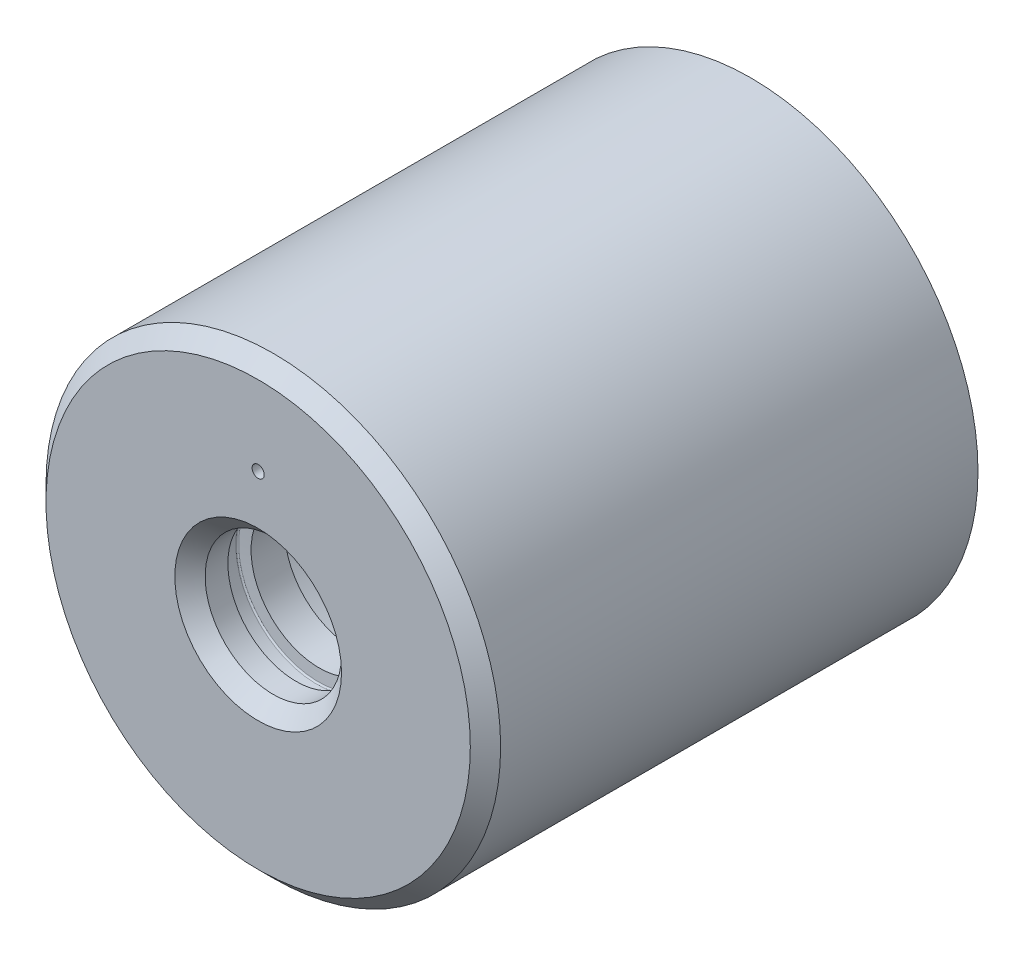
ISO-10303-21;
HEADER;
FILE_DESCRIPTION(('STEP AP214'),'2;1');
FILE_NAME('part.step','',(''),(''),'','','');
FILE_SCHEMA(('AUTOMOTIVE_DESIGN { 1 0 10303 214 1 1 1 1 }'));
ENDSEC;
DATA;
#1=APPLICATION_CONTEXT('core data for automotive mechanical design processes');
#2=APPLICATION_PROTOCOL_DEFINITION('international standard','automotive_design',2000,#1);
#3=PRODUCT_CONTEXT('',#1,'mechanical');
#4=PRODUCT('Part','Part','',(#3));
#5=PRODUCT_RELATED_PRODUCT_CATEGORY('part','',(#4));
#6=PRODUCT_DEFINITION_FORMATION('','',#4);
#7=PRODUCT_DEFINITION_CONTEXT('part definition',#1,'design');
#8=PRODUCT_DEFINITION('design','',#6,#7);
#9=PRODUCT_DEFINITION_SHAPE('','',#8);
#10=(LENGTH_UNIT() NAMED_UNIT(*) SI_UNIT(.MILLI.,.METRE.));
#11=(NAMED_UNIT(*) PLANE_ANGLE_UNIT() SI_UNIT($,.RADIAN.));
#12=(NAMED_UNIT(*) SI_UNIT($,.STERADIAN.) SOLID_ANGLE_UNIT());
#13=UNCERTAINTY_MEASURE_WITH_UNIT(LENGTH_MEASURE(1.E-05),#10,'distance_accuracy_value','');
#14=(GEOMETRIC_REPRESENTATION_CONTEXT(3) GLOBAL_UNCERTAINTY_ASSIGNED_CONTEXT((#13)) GLOBAL_UNIT_ASSIGNED_CONTEXT((#10,
#11,#12)) REPRESENTATION_CONTEXT('',''));
#15=CARTESIAN_POINT('',(0.,0.,0.));
#16=DIRECTION('',(0.,0.,1.));
#17=DIRECTION('',(1.,0.,0.));
#18=AXIS2_PLACEMENT_3D('',#15,#16,#17);
#19=CARTESIAN_POINT('',(0.,0.,82.55));
#20=DIRECTION('',(0.,0.,-1.));
#21=DIRECTION('',(-1.,0.,0.));
#22=AXIS2_PLACEMENT_3D('',#19,#20,#21);
#23=CYLINDRICAL_SURFACE('',#22,11.43);
#24=CARTESIAN_POINT('',(0.,0.,72.309016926));
#25=DIRECTION('',(0.,0.,1.));
#26=DIRECTION('',(1.,0.,0.));
#27=AXIS2_PLACEMENT_3D('',#24,#25,#26);
#28=CIRCLE('',#27,11.43);
#29=CARTESIAN_POINT('',(11.43,0.,72.309016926));
#30=VERTEX_POINT('',#29);
#31=EDGE_CURVE('E70',#30,#30,#28,.T.);
#32=ORIENTED_EDGE('',*,*,#31,.T.);
#33=EDGE_LOOP('',(#32));
#34=FACE_BOUND('',#33,.T.);
#35=CARTESIAN_POINT('',(0.,0.,66.675));
#36=DIRECTION('',(0.,0.,1.));
#37=DIRECTION('',(1.,0.,0.));
#38=AXIS2_PLACEMENT_3D('',#35,#36,#37);
#39=CIRCLE('',#38,11.43);
#40=CARTESIAN_POINT('',(11.43,0.,66.675));
#41=VERTEX_POINT('',#40);
#42=EDGE_CURVE('E61',#41,#41,#39,.T.);
#43=ORIENTED_EDGE('',*,*,#42,.F.);
#44=EDGE_LOOP('',(#43));
#45=FACE_BOUND('',#44,.T.);
#46=ADVANCED_FACE('F32',(#34,#45),#23,.F.);
#47=CARTESIAN_POINT('',(0.,0.,0.));
#48=DIRECTION('',(0.,0.,1.));
#49=DIRECTION('',(1.,0.,0.));
#50=AXIS2_PLACEMENT_3D('',#47,#48,#49);
#51=PLANE('',#50);
#52=CARTESIAN_POINT('',(0.,0.,0.));
#53=DIRECTION('',(0.,0.,1.));
#54=DIRECTION('',(1.,0.,0.));
#55=AXIS2_PLACEMENT_3D('',#52,#53,#54);
#56=CIRCLE('',#55,38.1);
#57=CARTESIAN_POINT('',(38.1,0.,0.));
#58=VERTEX_POINT('',#57);
#59=EDGE_CURVE('E52',#58,#58,#56,.T.);
#60=ORIENTED_EDGE('',*,*,#59,.F.);
#61=EDGE_LOOP('',(#60));
#62=FACE_BOUND('',#61,.T.);
#63=CARTESIAN_POINT('',(0.,0.,0.));
#64=DIRECTION('',(0.,0.,1.));
#65=DIRECTION('',(1.,0.,0.));
#66=AXIS2_PLACEMENT_3D('',#63,#64,#65);
#67=CIRCLE('',#66,26.67);
#68=CARTESIAN_POINT('',(26.67,0.,0.));
#69=VERTEX_POINT('',#68);
#70=EDGE_CURVE('E55',#69,#69,#67,.T.);
#71=ORIENTED_EDGE('',*,*,#70,.T.);
#72=EDGE_LOOP('',(#71));
#73=FACE_BOUND('',#72,.T.);
#74=ADVANCED_FACE('F127',(#62,#73),#51,.F.);
#75=CARTESIAN_POINT('',(0.,0.,66.675));
#76=DIRECTION('',(0.,0.,-1.));
#77=DIRECTION('',(-1.,0.,0.));
#78=AXIS2_PLACEMENT_3D('',#75,#76,#77);
#79=CYLINDRICAL_SURFACE('',#78,38.1);
#80=CARTESIAN_POINT('',(0.,0.,80.01));
#81=DIRECTION('',(0.,0.,1.));
#82=DIRECTION('',(1.,0.,0.));
#83=AXIS2_PLACEMENT_3D('',#80,#81,#82);
#84=CIRCLE('',#83,38.1);
#85=CARTESIAN_POINT('',(38.1,0.,80.01));
#86=VERTEX_POINT('',#85);
#87=EDGE_CURVE('E10',#86,#86,#84,.F.);
#88=ORIENTED_EDGE('',*,*,#87,.T.);
#89=EDGE_LOOP('',(#88));
#90=FACE_BOUND('',#89,.T.);
#91=ORIENTED_EDGE('',*,*,#59,.T.);
#92=EDGE_LOOP('',(#91));
#93=FACE_BOUND('',#92,.T.);
#94=ADVANCED_FACE('F34',(#90,#93),#79,.T.);
#95=CARTESIAN_POINT('',(0.,0.,66.675));
#96=DIRECTION('',(0.,0.,-1.));
#97=DIRECTION('',(-1.,0.,0.));
#98=AXIS2_PLACEMENT_3D('',#95,#96,#97);
#99=CYLINDRICAL_SURFACE('',#98,26.67);
#100=CARTESIAN_POINT('',(0.,0.,66.675));
#101=DIRECTION('',(0.,0.,1.));
#102=DIRECTION('',(1.,0.,0.));
#103=AXIS2_PLACEMENT_3D('',#100,#101,#102);
#104=CIRCLE('',#103,26.67);
#105=CARTESIAN_POINT('',(26.67,0.,66.675));
#106=VERTEX_POINT('',#105);
#107=EDGE_CURVE('E58',#106,#106,#104,.T.);
#108=ORIENTED_EDGE('',*,*,#107,.T.);
#109=EDGE_LOOP('',(#108));
#110=FACE_BOUND('',#109,.T.);
#111=ORIENTED_EDGE('',*,*,#70,.F.);
#112=EDGE_LOOP('',(#111));
#113=FACE_BOUND('',#112,.T.);
#114=ADVANCED_FACE('F141',(#110,#113),#99,.F.);
#115=CARTESIAN_POINT('',(0.,0.,82.55));
#116=DIRECTION('',(0.,0.,1.));
#117=DIRECTION('',(1.,0.,0.));
#118=AXIS2_PLACEMENT_3D('',#115,#116,#117);
#119=PLANE('',#118);
#120=CARTESIAN_POINT('',(0.,22.225,82.55));
#121=DIRECTION('',(0.,0.,1.));
#122=DIRECTION('',(1.,0.,0.));
#123=AXIS2_PLACEMENT_3D('',#120,#121,#122);
#124=CIRCLE('',#123,1.016);
#125=CARTESIAN_POINT('',(1.016,22.225,82.55));
#126=VERTEX_POINT('',#125);
#127=EDGE_CURVE('E64',#126,#126,#124,.T.);
#128=ORIENTED_EDGE('',*,*,#127,.F.);
#129=EDGE_LOOP('',(#128));
#130=FACE_BOUND('',#129,.T.);
#131=CARTESIAN_POINT('',(0.,0.,82.55));
#132=DIRECTION('',(0.,0.,1.));
#133=DIRECTION('',(1.,0.,0.));
#134=AXIS2_PLACEMENT_3D('',#131,#132,#133);
#135=CIRCLE('',#134,13.97);
#136=CARTESIAN_POINT('',(13.9700000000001,0.,82.55));
#137=VERTEX_POINT('',#136);
#138=EDGE_CURVE('E40',#137,#137,#135,.F.);
#139=ORIENTED_EDGE('',*,*,#138,.T.);
#140=EDGE_LOOP('',(#139));
#141=FACE_BOUND('',#140,.T.);
#142=CARTESIAN_POINT('',(0.,0.,82.55));
#143=DIRECTION('',(0.,0.,1.));
#144=DIRECTION('',(1.,0.,0.));
#145=AXIS2_PLACEMENT_3D('',#142,#143,#144);
#146=CIRCLE('',#145,35.56);
#147=CARTESIAN_POINT('',(35.56,0.,82.55));
#148=VERTEX_POINT('',#147);
#149=EDGE_CURVE('E44',#148,#148,#146,.T.);
#150=ORIENTED_EDGE('',*,*,#149,.T.);
#151=EDGE_LOOP('',(#150));
#152=FACE_BOUND('',#151,.T.);
#153=ADVANCED_FACE('F137',(#130,#141,#152),#119,.T.);
#154=CARTESIAN_POINT('',(0.,0.,66.675));
#155=DIRECTION('',(0.,0.,1.));
#156=DIRECTION('',(1.,0.,0.));
#157=AXIS2_PLACEMENT_3D('',#154,#155,#156);
#158=PLANE('',#157);
#159=CARTESIAN_POINT('',(0.,22.225,66.675));
#160=DIRECTION('',(0.,0.,1.));
#161=DIRECTION('',(1.,0.,0.));
#162=AXIS2_PLACEMENT_3D('',#159,#160,#161);
#163=CIRCLE('',#162,1.016);
#164=CARTESIAN_POINT('',(1.016,22.225,66.675));
#165=VERTEX_POINT('',#164);
#166=EDGE_CURVE('E36',#165,#165,#163,.T.);
#167=ORIENTED_EDGE('',*,*,#166,.T.);
#168=EDGE_LOOP('',(#167));
#169=FACE_BOUND('',#168,.T.);
#170=ORIENTED_EDGE('',*,*,#107,.F.);
#171=EDGE_LOOP('',(#170));
#172=FACE_BOUND('',#171,.T.);
#173=ORIENTED_EDGE('',*,*,#42,.T.);
#174=EDGE_LOOP('',(#173));
#175=FACE_BOUND('',#174,.T.);
#176=ADVANCED_FACE('F111',(#169,#172,#175),#158,.F.);
#177=CARTESIAN_POINT('',(0.,0.,76.2));
#178=DIRECTION('',(0.,0.,1.));
#179=DIRECTION('',(1.,0.,0.));
#180=AXIS2_PLACEMENT_3D('',#177,#178,#179);
#181=CIRCLE('',#180,11.43);
#182=CARTESIAN_POINT('',(11.43,0.,76.2));
#183=VERTEX_POINT('',#182);
#184=EDGE_CURVE('E73',#183,#183,#181,.T.);
#185=ORIENTED_EDGE('',*,*,#184,.F.);
#186=EDGE_LOOP('',(#185));
#187=FACE_BOUND('',#186,.T.);
#188=CARTESIAN_POINT('',(0.,0.,80.01));
#189=DIRECTION('',(0.,0.,1.));
#190=DIRECTION('',(1.,0.,0.));
#191=AXIS2_PLACEMENT_3D('',#188,#189,#190);
#192=CIRCLE('',#191,11.43);
#193=CARTESIAN_POINT('',(11.43,0.,80.01));
#194=VERTEX_POINT('',#193);
#195=EDGE_CURVE('E49',#194,#194,#192,.T.);
#196=ORIENTED_EDGE('',*,*,#195,.T.);
#197=EDGE_LOOP('',(#196));
#198=FACE_BOUND('',#197,.T.);
#199=ADVANCED_FACE('F107',(#187,#198),#23,.F.);
#200=CARTESIAN_POINT('',(0.,0.,80.01));
#201=DIRECTION('',(0.,0.,1.));
#202=DIRECTION('',(1.,0.,0.));
#203=AXIS2_PLACEMENT_3D('',#200,#201,#202);
#204=CONICAL_SURFACE('',#203,11.43,0.78539816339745);
#205=ORIENTED_EDGE('',*,*,#138,.F.);
#206=EDGE_LOOP('',(#205));
#207=FACE_BOUND('',#206,.T.);
#208=ORIENTED_EDGE('',*,*,#195,.F.);
#209=EDGE_LOOP('',(#208));
#210=FACE_BOUND('',#209,.T.);
#211=ADVANCED_FACE('F110',(#207,#210),#204,.F.);
#212=CARTESIAN_POINT('',(0.,0.,82.55));
#213=DIRECTION('',(0.,0.,-1.));
#214=DIRECTION('',(-1.,0.,0.));
#215=AXIS2_PLACEMENT_3D('',#212,#213,#214);
#216=CONICAL_SURFACE('',#215,35.56,0.785398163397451);
#217=ORIENTED_EDGE('',*,*,#87,.F.);
#218=EDGE_LOOP('',(#217));
#219=FACE_BOUND('',#218,.T.);
#220=ORIENTED_EDGE('',*,*,#149,.F.);
#221=EDGE_LOOP('',(#220));
#222=FACE_BOUND('',#221,.T.);
#223=ADVANCED_FACE('F116',(#219,#222),#216,.T.);
#224=CARTESIAN_POINT('',(0.,22.225,0.));
#225=DIRECTION('',(0.,0.,1.));
#226=DIRECTION('',(1.,0.,0.));
#227=AXIS2_PLACEMENT_3D('',#224,#225,#226);
#228=CYLINDRICAL_SURFACE('',#227,1.016);
#229=ORIENTED_EDGE('',*,*,#127,.T.);
#230=EDGE_LOOP('',(#229));
#231=FACE_BOUND('',#230,.T.);
#232=ORIENTED_EDGE('',*,*,#166,.F.);
#233=EDGE_LOOP('',(#232));
#234=FACE_BOUND('',#233,.T.);
#235=ADVANCED_FACE('F122',(#231,#234),#228,.F.);
#236=CARTESIAN_POINT('',(0.,0.,72.7295419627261));
#237=DIRECTION('',(0.,0.,1.));
#238=DIRECTION('',(1.,0.,0.));
#239=AXIS2_PLACEMENT_3D('',#236,#237,#238);
#240=TOROIDAL_SURFACE('',#239,13.3223,0.254000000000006);
#241=CARTESIAN_POINT('',(0.,0.,72.4765085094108));
#242=DIRECTION('',(0.,0.,1.));
#243=DIRECTION('',(1.,0.,0.));
#244=AXIS2_PLACEMENT_3D('',#241,#242,#243);
#245=CIRCLE('',#244,13.3444375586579);
#246=CARTESIAN_POINT('',(13.3444375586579,0.,72.4765085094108));
#247=VERTEX_POINT('',#246);
#248=EDGE_CURVE('E67',#247,#247,#245,.T.);
#249=ORIENTED_EDGE('',*,*,#248,.F.);
#250=EDGE_LOOP('',(#249));
#251=FACE_BOUND('',#250,.T.);
#252=CARTESIAN_POINT('',(0.,0.,72.7295419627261));
#253=DIRECTION('',(0.,0.,1.));
#254=DIRECTION('',(1.,0.,0.));
#255=AXIS2_PLACEMENT_3D('',#252,#253,#254);
#256=CIRCLE('',#255,13.5763);
#257=CARTESIAN_POINT('',(13.5763,0.,72.7295419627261));
#258=VERTEX_POINT('',#257);
#259=EDGE_CURVE('E82',#258,#258,#256,.T.);
#260=ORIENTED_EDGE('',*,*,#259,.T.);
#261=EDGE_LOOP('',(#260));
#262=FACE_BOUND('',#261,.T.);
#263=ADVANCED_FACE('F86',(#251,#262),#240,.F.);
#264=CARTESIAN_POINT('',(0.,0.,72.4765085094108));
#265=DIRECTION('',(0.,0.,1.));
#266=DIRECTION('',(1.,0.,0.));
#267=AXIS2_PLACEMENT_3D('',#264,#265,#266);
#268=CONICAL_SURFACE('',#267,13.3444375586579,1.48352986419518);
#269=ORIENTED_EDGE('',*,*,#31,.F.);
#270=EDGE_LOOP('',(#269));
#271=FACE_BOUND('',#270,.T.);
#272=ORIENTED_EDGE('',*,*,#248,.T.);
#273=EDGE_LOOP('',(#272));
#274=FACE_BOUND('',#273,.T.);
#275=ADVANCED_FACE('F103',(#271,#274),#268,.F.);
#276=CARTESIAN_POINT('',(0.,0.,76.2));
#277=DIRECTION('',(0.,0.,-1.));
#278=DIRECTION('',(-1.,0.,0.));
#279=AXIS2_PLACEMENT_3D('',#276,#277,#278);
#280=CONICAL_SURFACE('',#279,11.43,1.48352986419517);
#281=CARTESIAN_POINT('',(0.,0.,76.0325084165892));
#282=DIRECTION('',(0.,0.,1.));
#283=DIRECTION('',(1.,0.,0.));
#284=AXIS2_PLACEMENT_3D('',#281,#282,#283);
#285=CIRCLE('',#284,13.3444375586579);
#286=CARTESIAN_POINT('',(13.344437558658,0.,76.0325084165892));
#287=VERTEX_POINT('',#286);
#288=EDGE_CURVE('E76',#287,#287,#285,.T.);
#289=ORIENTED_EDGE('',*,*,#288,.F.);
#290=EDGE_LOOP('',(#289));
#291=FACE_BOUND('',#290,.T.);
#292=ORIENTED_EDGE('',*,*,#184,.T.);
#293=EDGE_LOOP('',(#292));
#294=FACE_BOUND('',#293,.T.);
#295=ADVANCED_FACE('F97',(#291,#294),#280,.F.);
#296=CARTESIAN_POINT('',(0.,0.,75.7794749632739));
#297=DIRECTION('',(0.,0.,1.));
#298=DIRECTION('',(1.,0.,0.));
#299=AXIS2_PLACEMENT_3D('',#296,#297,#298);
#300=TOROIDAL_SURFACE('',#299,13.3223,0.253999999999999);
#301=CARTESIAN_POINT('',(0.,0.,75.7794749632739));
#302=DIRECTION('',(0.,0.,1.));
#303=DIRECTION('',(1.,0.,0.));
#304=AXIS2_PLACEMENT_3D('',#301,#302,#303);
#305=CIRCLE('',#304,13.5763);
#306=CARTESIAN_POINT('',(13.5763,0.,75.7794749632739));
#307=VERTEX_POINT('',#306);
#308=EDGE_CURVE('E79',#307,#307,#305,.T.);
#309=ORIENTED_EDGE('',*,*,#308,.F.);
#310=EDGE_LOOP('',(#309));
#311=FACE_BOUND('',#310,.T.);
#312=ORIENTED_EDGE('',*,*,#288,.T.);
#313=EDGE_LOOP('',(#312));
#314=FACE_BOUND('',#313,.T.);
#315=ADVANCED_FACE('F91',(#311,#314),#300,.F.);
#316=CARTESIAN_POINT('',(0.,0.,32.55));
#317=DIRECTION('',(0.,0.,1.));
#318=DIRECTION('',(1.,0.,0.));
#319=AXIS2_PLACEMENT_3D('',#316,#317,#318);
#320=CYLINDRICAL_SURFACE('',#319,13.5763);
#321=ORIENTED_EDGE('',*,*,#259,.F.);
#322=EDGE_LOOP('',(#321));
#323=FACE_BOUND('',#322,.T.);
#324=ORIENTED_EDGE('',*,*,#308,.T.);
#325=EDGE_LOOP('',(#324));
#326=FACE_BOUND('',#325,.T.);
#327=ADVANCED_FACE('F88',(#323,#326),#320,.F.);
#328=CLOSED_SHELL('',(#46,#74,#94,#114,#153,#176,#199,#211,#223,#235,#263,#275,#295,#315,#327));
#329=MANIFOLD_SOLID_BREP('B2',#328);
#330=ADVANCED_BREP_SHAPE_REPRESENTATION('',(#18,#329),#14);
#331=SHAPE_DEFINITION_REPRESENTATION(#9,#330);
ENDSEC;
END-ISO-10303-21;
